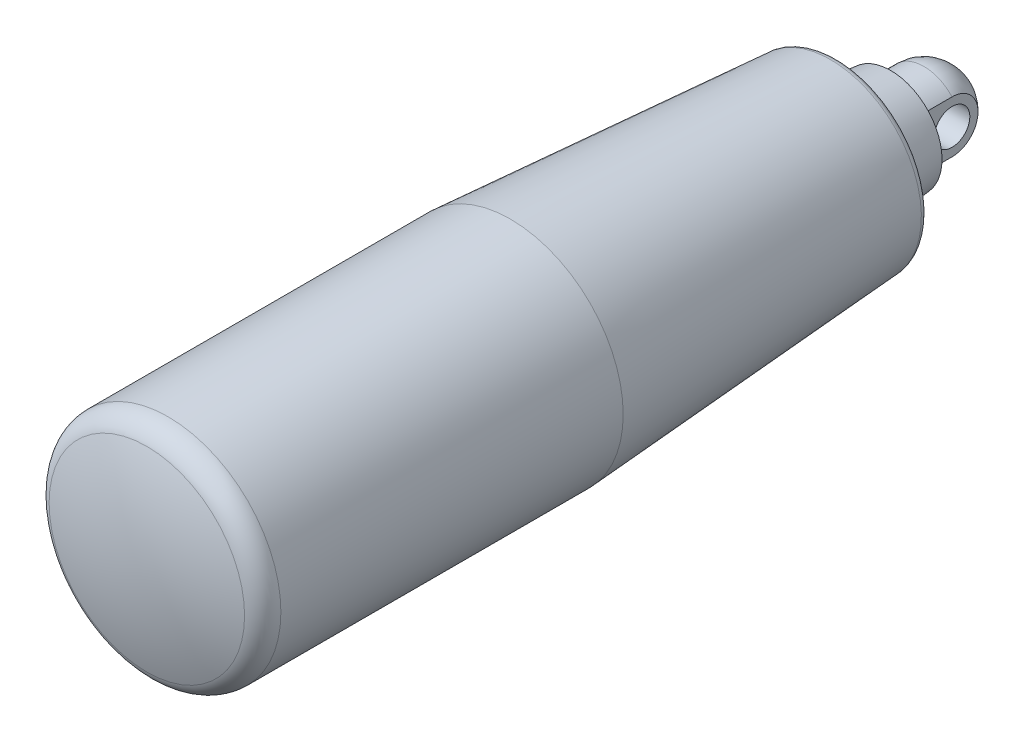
ISO-10303-21;
HEADER;
FILE_DESCRIPTION(('STEP AP214'),'2;1');
FILE_NAME('part.step','',(''),(''),'','','');
FILE_SCHEMA(('AUTOMOTIVE_DESIGN { 1 0 10303 214 1 1 1 1 }'));
ENDSEC;
DATA;
#1=APPLICATION_CONTEXT('core data for automotive mechanical design processes');
#2=APPLICATION_PROTOCOL_DEFINITION('international standard','automotive_design',2000,#1);
#3=PRODUCT_CONTEXT('',#1,'mechanical');
#4=PRODUCT('Part','Part','',(#3));
#5=PRODUCT_RELATED_PRODUCT_CATEGORY('part','',(#4));
#6=PRODUCT_DEFINITION_FORMATION('','',#4);
#7=PRODUCT_DEFINITION_CONTEXT('part definition',#1,'design');
#8=PRODUCT_DEFINITION('design','',#6,#7);
#9=PRODUCT_DEFINITION_SHAPE('','',#8);
#10=(LENGTH_UNIT() NAMED_UNIT(*) SI_UNIT(.MILLI.,.METRE.));
#11=(NAMED_UNIT(*) PLANE_ANGLE_UNIT() SI_UNIT($,.RADIAN.));
#12=(NAMED_UNIT(*) SI_UNIT($,.STERADIAN.) SOLID_ANGLE_UNIT());
#13=UNCERTAINTY_MEASURE_WITH_UNIT(LENGTH_MEASURE(1.E-05),#10,'distance_accuracy_value','');
#14=(GEOMETRIC_REPRESENTATION_CONTEXT(3) GLOBAL_UNCERTAINTY_ASSIGNED_CONTEXT((#13)) GLOBAL_UNIT_ASSIGNED_CONTEXT((#10,
#11,#12)) REPRESENTATION_CONTEXT('',''));
#15=CARTESIAN_POINT('',(0.,0.,0.));
#16=DIRECTION('',(0.,0.,1.));
#17=DIRECTION('',(1.,0.,0.));
#18=AXIS2_PLACEMENT_3D('',#15,#16,#17);
#19=CARTESIAN_POINT('',(20.,0.,0.));
#20=DIRECTION('',(1.,0.,0.));
#21=DIRECTION('',(0.,1.,0.));
#22=AXIS2_PLACEMENT_3D('',#19,#20,#21);
#23=CYLINDRICAL_SURFACE('',#22,2.);
#24=CARTESIAN_POINT('',(-3.1875,0.,0.));
#25=DIRECTION('',(1.,0.,0.));
#26=DIRECTION('',(0.,1.,0.));
#27=AXIS2_PLACEMENT_3D('',#24,#25,#26);
#28=CIRCLE('',#27,2.);
#29=CARTESIAN_POINT('',(-3.1875,2.,0.));
#30=VERTEX_POINT('',#29);
#31=EDGE_CURVE('E86',#30,#30,#28,.F.);
#32=ORIENTED_EDGE('',*,*,#31,.T.);
#33=EDGE_LOOP('',(#32));
#34=FACE_BOUND('',#33,.T.);
#35=CARTESIAN_POINT('',(3.1875,0.,0.));
#36=DIRECTION('',(1.,0.,0.));
#37=DIRECTION('',(0.,1.,0.));
#38=AXIS2_PLACEMENT_3D('',#35,#36,#37);
#39=CIRCLE('',#38,2.);
#40=CARTESIAN_POINT('',(3.1875,2.,0.));
#41=VERTEX_POINT('',#40);
#42=EDGE_CURVE('E19',#41,#41,#39,.F.);
#43=ORIENTED_EDGE('',*,*,#42,.F.);
#44=EDGE_LOOP('',(#43));
#45=FACE_BOUND('',#44,.T.);
#46=ADVANCED_FACE('F14',(#34,#45),#23,.F.);
#47=CARTESIAN_POINT('',(0.00999999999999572,0.,0.00999999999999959));
#48=DIRECTION('',(0.,-1.,0.));
#49=DIRECTION('',(1.,0.,0.));
#50=AXIS2_PLACEMENT_3D('',#47,#48,#49);
#51=CIRCLE('',#50,4.325);
#52=TRIMMED_CURVE('',#51,(PARAMETER_VALUE(-1.57310846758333)),
(PARAMETER_VALUE(1.57310846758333)),.T.,.PARAMETER.);
#53=CARTESIAN_POINT('',(0.,0.,0.00999999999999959));
#54=DIRECTION('',(0.,0.,1.));
#55=AXIS1_PLACEMENT('',#53,#54);
#56=SURFACE_OF_REVOLUTION('',#52,#55);
#57=CARTESIAN_POINT('',(0.,0.,-4.31498843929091));
#58=VERTEX_POINT('',#57);
#59=VERTEX_LOOP('',#58);
#60=FACE_BOUND('',#59,.T.);
#61=CARTESIAN_POINT('',(0.,0.,0.00999999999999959));
#62=DIRECTION('',(0.,0.,-1.));
#63=DIRECTION('',(0.,1.,0.));
#64=AXIS2_PLACEMENT_3D('',#61,#62,#63);
#65=CIRCLE('',#64,4.335);
#66=CARTESIAN_POINT('',(3.1875,2.93803824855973,0.00999999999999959));
#67=VERTEX_POINT('',#66);
#68=CARTESIAN_POINT('',(-3.1875,2.93803824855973,0.00999999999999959));
#69=VERTEX_POINT('',#68);
#70=EDGE_CURVE('E64',#67,#69,#65,.F.);
#71=ORIENTED_EDGE('',*,*,#70,.F.);
#72=CARTESIAN_POINT('',(3.1875,-2.93803824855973,0.00999999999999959));
#73=CARTESIAN_POINT('',(3.1875,-2.93803772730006,-0.0725049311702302));
#74=CARTESIAN_POINT('',(3.1875,-2.93455271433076,-0.154970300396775));
#75=CARTESIAN_POINT('',(3.1875,-2.92064978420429,-0.319310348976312));
#76=CARTESIAN_POINT('',(3.1875,-2.91023220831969,-0.401185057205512));
#77=CARTESIAN_POINT('',(3.1875,-2.86867909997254,-0.644904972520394));
#78=CARTESIAN_POINT('',(3.1875,-2.82724291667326,-0.805116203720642));
#79=CARTESIAN_POINT('',(3.1875,-2.71805801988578,-1.11629702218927));
#80=CARTESIAN_POINT('',(3.1875,-2.65029724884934,-1.26726233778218));
#81=CARTESIAN_POINT('',(3.1875,-2.49040321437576,-1.55566794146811));
#82=CARTESIAN_POINT('',(3.1875,-2.39827465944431,-1.69311083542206));
#83=CARTESIAN_POINT('',(3.1875,-2.19225447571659,-1.95059619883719));
#84=CARTESIAN_POINT('',(3.1875,-2.07836075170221,-2.07063699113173));
#85=CARTESIAN_POINT('',(3.1875,-1.83203648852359,-2.28993589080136));
#86=CARTESIAN_POINT('',(3.1875,-1.69960308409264,-2.38919077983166));
#87=CARTESIAN_POINT('',(3.1875,-1.41984259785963,-2.56418085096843));
#88=CARTESIAN_POINT('',(3.1875,-1.27250161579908,-2.63989380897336));
#89=CARTESIAN_POINT('',(3.1875,-0.967222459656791,-2.76554542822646));
#90=CARTESIAN_POINT('',(3.1875,-0.809284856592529,-2.81548547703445));
#91=CARTESIAN_POINT('',(3.1875,-0.487035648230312,-2.88825864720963));
#92=CARTESIAN_POINT('',(3.1875,-0.322714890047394,-2.91105123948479));
#93=CARTESIAN_POINT('',(3.1875,0.00742633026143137,-2.9287593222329));
#94=CARTESIAN_POINT('',(3.1875,0.173246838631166,-2.92367395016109));
#95=CARTESIAN_POINT('',(3.1875,0.501860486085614,-2.8857454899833));
#96=CARTESIAN_POINT('',(3.1875,0.664650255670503,-2.85287319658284));
#97=CARTESIAN_POINT('',(3.1875,0.98239499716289,-2.7602511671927));
#98=CARTESIAN_POINT('',(3.1875,1.13735002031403,-2.70050160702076));
#99=CARTESIAN_POINT('',(3.1875,1.43493837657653,-2.55584022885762));
#100=CARTESIAN_POINT('',(3.1875,1.57757776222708,-2.47094086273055));
#101=CARTESIAN_POINT('',(3.1875,1.84654328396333,-2.27836992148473));
#102=CARTESIAN_POINT('',(3.1875,1.97287033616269,-2.17069962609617));
#103=CARTESIAN_POINT('',(3.1875,2.20542039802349,-1.93583060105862));
#104=CARTESIAN_POINT('',(3.1875,2.31167541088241,-1.80866355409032));
#105=CARTESIAN_POINT('',(3.1875,2.50133092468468,-1.53822800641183));
#106=CARTESIAN_POINT('',(3.1875,2.58472427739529,-1.39495448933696));
#107=CARTESIAN_POINT('',(3.1875,2.72618380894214,-1.09654409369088));
#108=CARTESIAN_POINT('',(3.1875,2.78426513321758,-0.941414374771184));
#109=CARTESIAN_POINT('',(3.1875,2.87345116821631,-0.623723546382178));
#110=CARTESIAN_POINT('',(3.1875,2.90459729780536,-0.461174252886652));
#111=CARTESIAN_POINT('',(3.1875,2.92726749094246,-0.246288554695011));
#112=CARTESIAN_POINT('',(3.1875,2.9313086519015,-0.195069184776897));
#113=CARTESIAN_POINT('',(3.1875,2.93669033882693,-0.0925734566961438));
#114=CARTESIAN_POINT('',(3.1875,2.93803531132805,-0.0412973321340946));
#115=CARTESIAN_POINT('',(3.1875,2.93803824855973,0.00999999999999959));
#116=B_SPLINE_CURVE_WITH_KNOTS('',3,(#72,#73,#74,#75,#76,#77,#78,#79,#80,#81,#82,#83,#84,#85,
#86,#87,#88,#89,#90,#91,#92,#93,#94,#95,#96,#97,#98,#99,#100,#101,#102,#103,#104,#105,#106,#107,
#108,#109,#110,#111,#112,#113,#114,#115),.UNSPECIFIED.,.F.,.F.,(4,2,2,2,2,2,2,2,2,2,2,2,2,2,2,2,
2,2,2,2,2,4),(0.,0.247362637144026,0.494713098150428,0.988613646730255,1.48274068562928,
1.97677231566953,2.47085152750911,2.96500718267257,3.45962792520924,3.95422203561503,
4.44955361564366,4.94490052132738,5.4407687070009,5.93663364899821,6.43225349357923,
6.92784549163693,7.42264051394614,7.91759006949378,8.4122430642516,8.90613406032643,
9.06022034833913,9.21405230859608),.UNSPECIFIED.);
#117=CARTESIAN_POINT('',(3.1875,-2.93803824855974,0.00999999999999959));
#118=VERTEX_POINT('',#117);
#119=EDGE_CURVE('E57',#118,#67,#116,.T.);
#120=ORIENTED_EDGE('',*,*,#119,.F.);
#121=CARTESIAN_POINT('',(0.,0.,0.00999999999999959));
#122=DIRECTION('',(0.,0.,-1.));
#123=DIRECTION('',(0.,1.,0.));
#124=AXIS2_PLACEMENT_3D('',#121,#122,#123);
#125=CIRCLE('',#124,4.335);
#126=CARTESIAN_POINT('',(-3.1875,-2.93803824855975,0.00999999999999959));
#127=VERTEX_POINT('',#126);
#128=EDGE_CURVE('E89',#127,#118,#125,.F.);
#129=ORIENTED_EDGE('',*,*,#128,.F.);
#130=CARTESIAN_POINT('',(-3.1875,-2.93803824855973,0.00999999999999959));
#131=CARTESIAN_POINT('',(-3.1875,-2.93803772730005,-0.0725049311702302));
#132=CARTESIAN_POINT('',(-3.1875,-2.93455271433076,-0.154970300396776));
#133=CARTESIAN_POINT('',(-3.1875,-2.92064978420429,-0.319310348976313));
#134=CARTESIAN_POINT('',(-3.1875,-2.91023220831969,-0.401185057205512));
#135=CARTESIAN_POINT('',(-3.1875,-2.86867909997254,-0.644904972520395));
#136=CARTESIAN_POINT('',(-3.1875,-2.82724291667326,-0.805116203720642));
#137=CARTESIAN_POINT('',(-3.1875,-2.71805801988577,-1.11629702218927));
#138=CARTESIAN_POINT('',(-3.1875,-2.65029724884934,-1.26726233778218));
#139=CARTESIAN_POINT('',(-3.1875,-2.49040321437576,-1.55566794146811));
#140=CARTESIAN_POINT('',(-3.1875,-2.39827465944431,-1.69311083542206));
#141=CARTESIAN_POINT('',(-3.1875,-2.19225447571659,-1.95059619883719));
#142=CARTESIAN_POINT('',(-3.1875,-2.07836075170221,-2.07063699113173));
#143=CARTESIAN_POINT('',(-3.1875,-1.83203648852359,-2.28993589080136));
#144=CARTESIAN_POINT('',(-3.1875,-1.69960308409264,-2.38919077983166));
#145=CARTESIAN_POINT('',(-3.1875,-1.41984259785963,-2.56418085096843));
#146=CARTESIAN_POINT('',(-3.1875,-1.27250161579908,-2.63989380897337));
#147=CARTESIAN_POINT('',(-3.1875,-0.967222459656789,-2.76554542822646));
#148=CARTESIAN_POINT('',(-3.1875,-0.809284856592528,-2.81548547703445));
#149=CARTESIAN_POINT('',(-3.1875,-0.48703564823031,-2.88825864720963));
#150=CARTESIAN_POINT('',(-3.1875,-0.322714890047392,-2.91105123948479));
#151=CARTESIAN_POINT('',(-3.1875,0.00742633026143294,-2.9287593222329));
#152=CARTESIAN_POINT('',(-3.1875,0.173246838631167,-2.92367395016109));
#153=CARTESIAN_POINT('',(-3.1875,0.501860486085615,-2.8857454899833));
#154=CARTESIAN_POINT('',(-3.1875,0.664650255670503,-2.85287319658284));
#155=CARTESIAN_POINT('',(-3.1875,0.982394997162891,-2.7602511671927));
#156=CARTESIAN_POINT('',(-3.1875,1.13735002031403,-2.70050160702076));
#157=CARTESIAN_POINT('',(-3.1875,1.43493837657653,-2.55584022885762));
#158=CARTESIAN_POINT('',(-3.1875,1.57757776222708,-2.47094086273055));
#159=CARTESIAN_POINT('',(-3.1875,1.84654328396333,-2.27836992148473));
#160=CARTESIAN_POINT('',(-3.1875,1.9728703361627,-2.17069962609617));
#161=CARTESIAN_POINT('',(-3.1875,2.20542039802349,-1.93583060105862));
#162=CARTESIAN_POINT('',(-3.1875,2.31167541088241,-1.80866355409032));
#163=CARTESIAN_POINT('',(-3.1875,2.50133092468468,-1.53822800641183));
#164=CARTESIAN_POINT('',(-3.1875,2.58472427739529,-1.39495448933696));
#165=CARTESIAN_POINT('',(-3.1875,2.72618380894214,-1.09654409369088));
#166=CARTESIAN_POINT('',(-3.1875,2.78426513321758,-0.941414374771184));
#167=CARTESIAN_POINT('',(-3.1875,2.87345116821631,-0.623723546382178));
#168=CARTESIAN_POINT('',(-3.1875,2.90459729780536,-0.461174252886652));
#169=CARTESIAN_POINT('',(-3.1875,2.92726749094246,-0.246288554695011));
#170=CARTESIAN_POINT('',(-3.1875,2.9313086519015,-0.195069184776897));
#171=CARTESIAN_POINT('',(-3.1875,2.93669033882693,-0.0925734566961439));
#172=CARTESIAN_POINT('',(-3.1875,2.93803531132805,-0.0412973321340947));
#173=CARTESIAN_POINT('',(-3.1875,2.93803824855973,0.00999999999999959));
#174=B_SPLINE_CURVE_WITH_KNOTS('',3,(#130,#131,#132,#133,#134,#135,#136,#137,#138,#139,#140,
#141,#142,#143,#144,#145,#146,#147,#148,#149,#150,#151,#152,#153,#154,#155,#156,#157,#158,#159,
#160,#161,#162,#163,#164,#165,#166,#167,#168,#169,#170,#171,#172,#173),.UNSPECIFIED.,.F.,.F.,(4,
2,2,2,2,2,2,2,2,2,2,2,2,2,2,2,2,2,2,2,2,4),(0.,0.247362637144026,0.494713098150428,
0.988613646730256,1.48274068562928,1.97677231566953,2.47085152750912,2.96500718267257,
3.45962792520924,3.95422203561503,4.44955361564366,4.94490052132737,5.44076870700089,
5.93663364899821,6.43225349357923,6.92784549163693,7.42264051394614,7.91759006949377,
8.4122430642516,8.90613406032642,9.06022034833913,9.21405230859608),.UNSPECIFIED.);
#175=EDGE_CURVE('E67',#127,#69,#174,.T.);
#176=ORIENTED_EDGE('',*,*,#175,.T.);
#177=EDGE_LOOP('',(#71,#120,#129,#176));
#178=FACE_BOUND('',#177,.T.);
#179=ADVANCED_FACE('F16',(#60,#178),#56,.T.);
#180=CARTESIAN_POINT('',(3.1875,0.,-10.25));
#181=DIRECTION('',(1.,0.,0.));
#182=DIRECTION('',(0.,1.,0.));
#183=AXIS2_PLACEMENT_3D('',#180,#181,#182);
#184=PLANE('',#183);
#185=DIRECTION('',(0.,0.,-1.));
#186=VECTOR('',#185,1.);
#187=CARTESIAN_POINT('',(3.1875,-2.93803824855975,-4.31498843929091));
#188=LINE('',#187,#186);
#189=CARTESIAN_POINT('',(3.1875,-2.93803824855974,3.75));
#190=VERTEX_POINT('',#189);
#191=EDGE_CURVE('E87',#118,#190,#188,.F.);
#192=ORIENTED_EDGE('',*,*,#191,.F.);
#193=ORIENTED_EDGE('',*,*,#119,.T.);
#194=DIRECTION('',(0.,0.,-1.));
#195=VECTOR('',#194,1.);
#196=CARTESIAN_POINT('',(3.1875,2.93803824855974,-4.31498843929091));
#197=LINE('',#196,#195);
#198=CARTESIAN_POINT('',(3.1875,2.93803824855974,3.75));
#199=VERTEX_POINT('',#198);
#200=EDGE_CURVE('E70',#199,#67,#197,.T.);
#201=ORIENTED_EDGE('',*,*,#200,.F.);
#202=DIRECTION('',(0.,-1.,0.));
#203=VECTOR('',#202,1.);
#204=CARTESIAN_POINT('',(3.1875,0.,3.75));
#205=LINE('',#204,#203);
#206=EDGE_CURVE('E69',#199,#190,#205,.T.);
#207=ORIENTED_EDGE('',*,*,#206,.T.);
#208=EDGE_LOOP('',(#192,#193,#201,#207));
#209=FACE_BOUND('',#208,.T.);
#210=ORIENTED_EDGE('',*,*,#42,.T.);
#211=EDGE_LOOP('',(#210));
#212=FACE_BOUND('',#211,.T.);
#213=ADVANCED_FACE('F62',(#209,#212),#184,.T.);
#214=CARTESIAN_POINT('',(0.,0.,-4.31498843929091));
#215=DIRECTION('',(0.,0.,-1.));
#216=DIRECTION('',(0.,1.,0.));
#217=AXIS2_PLACEMENT_3D('',#214,#215,#216);
#218=CYLINDRICAL_SURFACE('',#217,4.335);
#219=ORIENTED_EDGE('',*,*,#128,.T.);
#220=ORIENTED_EDGE('',*,*,#191,.T.);
#221=CARTESIAN_POINT('',(0.,0.,3.75));
#222=DIRECTION('',(0.,0.,-1.));
#223=DIRECTION('',(0.,1.,0.));
#224=AXIS2_PLACEMENT_3D('',#221,#222,#223);
#225=CIRCLE('',#224,4.335);
#226=CARTESIAN_POINT('',(-3.1875,-2.93803824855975,3.75));
#227=VERTEX_POINT('',#226);
#228=EDGE_CURVE('E111',#190,#227,#225,.T.);
#229=ORIENTED_EDGE('',*,*,#228,.T.);
#230=DIRECTION('',(0.,0.,1.));
#231=VECTOR('',#230,1.);
#232=CARTESIAN_POINT('',(-3.1875,-2.93803824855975,-10.25));
#233=LINE('',#232,#231);
#234=EDGE_CURVE('E83',#227,#127,#233,.F.);
#235=ORIENTED_EDGE('',*,*,#234,.T.);
#236=EDGE_LOOP('',(#219,#220,#229,#235));
#237=FACE_BOUND('',#236,.T.);
#238=ADVANCED_FACE('F124',(#237),#218,.T.);
#239=CARTESIAN_POINT('',(-3.1875,0.,-10.25));
#240=DIRECTION('',(1.,0.,0.));
#241=DIRECTION('',(0.,1.,0.));
#242=AXIS2_PLACEMENT_3D('',#239,#240,#241);
#243=PLANE('',#242);
#244=DIRECTION('',(0.,0.,-1.));
#245=VECTOR('',#244,1.);
#246=CARTESIAN_POINT('',(-3.1875,2.93803824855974,-4.31498843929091));
#247=LINE('',#246,#245);
#248=CARTESIAN_POINT('',(-3.1875,2.93803824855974,3.75));
#249=VERTEX_POINT('',#248);
#250=EDGE_CURVE('E78',#69,#249,#247,.F.);
#251=ORIENTED_EDGE('',*,*,#250,.F.);
#252=ORIENTED_EDGE('',*,*,#175,.F.);
#253=ORIENTED_EDGE('',*,*,#234,.F.);
#254=DIRECTION('',(0.,-1.,0.));
#255=VECTOR('',#254,1.);
#256=CARTESIAN_POINT('',(-3.1875,0.,3.75));
#257=LINE('',#256,#255);
#258=EDGE_CURVE('E34',#227,#249,#257,.F.);
#259=ORIENTED_EDGE('',*,*,#258,.T.);
#260=EDGE_LOOP('',(#251,#252,#253,#259));
#261=FACE_BOUND('',#260,.T.);
#262=ORIENTED_EDGE('',*,*,#31,.F.);
#263=EDGE_LOOP('',(#262));
#264=FACE_BOUND('',#263,.T.);
#265=ADVANCED_FACE('F119',(#261,#264),#243,.F.);
#266=CARTESIAN_POINT('',(0.,0.,-4.31498843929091));
#267=DIRECTION('',(0.,0.,-1.));
#268=DIRECTION('',(0.,1.,0.));
#269=AXIS2_PLACEMENT_3D('',#266,#267,#268);
#270=CYLINDRICAL_SURFACE('',#269,4.335);
#271=ORIENTED_EDGE('',*,*,#200,.T.);
#272=ORIENTED_EDGE('',*,*,#70,.T.);
#273=ORIENTED_EDGE('',*,*,#250,.T.);
#274=CARTESIAN_POINT('',(0.,0.,3.75));
#275=DIRECTION('',(0.,0.,-1.));
#276=DIRECTION('',(0.,1.,0.));
#277=AXIS2_PLACEMENT_3D('',#274,#275,#276);
#278=CIRCLE('',#277,4.335);
#279=EDGE_CURVE('E75',#249,#199,#278,.T.);
#280=ORIENTED_EDGE('',*,*,#279,.T.);
#281=EDGE_LOOP('',(#271,#272,#273,#280));
#282=FACE_BOUND('',#281,.T.);
#283=ADVANCED_FACE('F73',(#282),#270,.T.);
#284=CARTESIAN_POINT('',(0.,0.,3.75));
#285=DIRECTION('',(0.,0.,1.));
#286=DIRECTION('',(0.,-1.,0.));
#287=AXIS2_PLACEMENT_3D('',#284,#285,#286);
#288=PLANE('',#287);
#289=ORIENTED_EDGE('',*,*,#258,.F.);
#290=ORIENTED_EDGE('',*,*,#228,.F.);
#291=ORIENTED_EDGE('',*,*,#206,.F.);
#292=ORIENTED_EDGE('',*,*,#279,.F.);
#293=EDGE_LOOP('',(#289,#290,#291,#292));
#294=FACE_BOUND('',#293,.T.);
#295=CARTESIAN_POINT('',(0.,0.,3.75000000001));
#296=DIRECTION('',(0.,0.,1.));
#297=DIRECTION('',(1.,0.,0.));
#298=AXIS2_PLACEMENT_3D('',#295,#296,#297);
#299=CIRCLE('',#298,5.79692670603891);
#300=CARTESIAN_POINT('',(5.79692670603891,0.,3.75000000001));
#301=VERTEX_POINT('',#300);
#302=EDGE_CURVE('E107',#301,#301,#299,.T.);
#303=ORIENTED_EDGE('',*,*,#302,.F.);
#304=EDGE_LOOP('',(#303));
#305=FACE_BOUND('',#304,.T.);
#306=ADVANCED_FACE('F210',(#294,#305),#288,.F.);
#307=CARTESIAN_POINT('',(0.,0.,9.24999999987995));
#308=DIRECTION('',(0.,0.,1.));
#309=DIRECTION('',(1.,0.,0.));
#310=AXIS2_PLACEMENT_3D('',#307,#308,#309);
#311=CONICAL_SURFACE('',#310,6.37499999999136,0.104719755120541);
#312=ORIENTED_EDGE('',*,*,#302,.T.);
#313=EDGE_LOOP('',(#312));
#314=FACE_BOUND('',#313,.T.);
#315=CARTESIAN_POINT('',(0.,0.,9.24999999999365));
#316=DIRECTION('',(0.,0.,1.));
#317=DIRECTION('',(1.,0.,0.));
#318=AXIS2_PLACEMENT_3D('',#315,#316,#317);
#319=CIRCLE('',#318,6.37500000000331);
#320=CARTESIAN_POINT('',(6.37500000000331,0.,9.24999999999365));
#321=VERTEX_POINT('',#320);
#322=EDGE_CURVE('E104',#321,#321,#319,.F.);
#323=ORIENTED_EDGE('',*,*,#322,.T.);
#324=EDGE_LOOP('',(#323));
#325=FACE_BOUND('',#324,.T.);
#326=ADVANCED_FACE('F213',(#314,#325),#311,.T.);
#327=CARTESIAN_POINT('',(0.,-6.375,9.25));
#328=DIRECTION('',(0.,0.,1.));
#329=DIRECTION('',(0.,-1.,0.));
#330=AXIS2_PLACEMENT_3D('',#327,#328,#329);
#331=PLANE('',#330);
#332=ORIENTED_EDGE('',*,*,#322,.F.);
#333=EDGE_LOOP('',(#332));
#334=FACE_BOUND('',#333,.T.);
#335=CARTESIAN_POINT('',(0.,0.,9.25));
#336=DIRECTION('',(0.,0.,-1.));
#337=DIRECTION('',(0.,1.,0.));
#338=AXIS2_PLACEMENT_3D('',#335,#336,#337);
#339=CIRCLE('',#338,8.925);
#340=CARTESIAN_POINT('',(0.,8.925,9.25));
#341=VERTEX_POINT('',#340);
#342=EDGE_CURVE('E101',#341,#341,#339,.F.);
#343=ORIENTED_EDGE('',*,*,#342,.F.);
#344=EDGE_LOOP('',(#343));
#345=FACE_BOUND('',#344,.T.);
#346=ADVANCED_FACE('F218',(#334,#345),#331,.F.);
#347=CARTESIAN_POINT('',(0.,0.,89.75));
#348=DIRECTION('',(0.,0.,-1.));
#349=DIRECTION('',(0.,1.,0.));
#350=AXIS2_PLACEMENT_3D('',#347,#348,#349);
#351=CYLINDRICAL_SURFACE('',#350,8.925);
#352=ORIENTED_EDGE('',*,*,#342,.T.);
#353=EDGE_LOOP('',(#352));
#354=FACE_BOUND('',#353,.T.);
#355=CARTESIAN_POINT('',(0.,0.,9.75));
#356=DIRECTION('',(0.,0.,-1.));
#357=DIRECTION('',(0.,1.,0.));
#358=AXIS2_PLACEMENT_3D('',#355,#356,#357);
#359=CIRCLE('',#358,8.925);
#360=CARTESIAN_POINT('',(0.,8.925,9.75));
#361=VERTEX_POINT('',#360);
#362=EDGE_CURVE('E98',#361,#361,#359,.T.);
#363=ORIENTED_EDGE('',*,*,#362,.T.);
#364=EDGE_LOOP('',(#363));
#365=FACE_BOUND('',#364,.T.);
#366=ADVANCED_FACE('F186',(#354,#365),#351,.T.);
#367=CARTESIAN_POINT('',(0.,-8.925,9.75));
#368=DIRECTION('',(0.,0.,1.));
#369=DIRECTION('',(0.,-1.,0.));
#370=AXIS2_PLACEMENT_3D('',#367,#368,#369);
#371=PLANE('',#370);
#372=ORIENTED_EDGE('',*,*,#362,.F.);
#373=EDGE_LOOP('',(#372));
#374=FACE_BOUND('',#373,.T.);
#375=CARTESIAN_POINT('',(0.,0.,9.75));
#376=DIRECTION('',(0.,0.,1.));
#377=DIRECTION('',(0.,-1.,0.));
#378=AXIS2_PLACEMENT_3D('',#375,#376,#377);
#379=CIRCLE('',#378,9.40656480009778);
#380=CARTESIAN_POINT('',(0.,-9.40656480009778,9.75));
#381=VERTEX_POINT('',#380);
#382=EDGE_CURVE('E97',#381,#381,#379,.T.);
#383=ORIENTED_EDGE('',*,*,#382,.F.);
#384=EDGE_LOOP('',(#383));
#385=FACE_BOUND('',#384,.T.);
#386=ADVANCED_FACE('F181',(#374,#385),#371,.F.);
#387=CARTESIAN_POINT('',(0.,1.66533453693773E-13,56.5999999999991));
#388=DIRECTION('',(0.,-1.,0.));
#389=DIRECTION('',(1.,0.,0.));
#390=AXIS2_PLACEMENT_3D('',#387,#388,#389);
#391=SPHERICAL_SURFACE('',#390,33.1500000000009);
#392=CARTESIAN_POINT('',(0.,0.,87.8541197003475));
#393=DIRECTION('',(0.,0.,1.));
#394=DIRECTION('',(0.,-1.,0.));
#395=AXIS2_PLACEMENT_3D('',#392,#393,#394);
#396=CIRCLE('',#395,11.0500000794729);
#397=CARTESIAN_POINT('',(0.,-11.0500000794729,87.8541197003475));
#398=VERTEX_POINT('',#397);
#399=EDGE_CURVE('E93',#398,#398,#396,.F.);
#400=ORIENTED_EDGE('',*,*,#399,.F.);
#401=EDGE_LOOP('',(#400));
#402=FACE_BOUND('',#401,.T.);
#403=ADVANCED_FACE('F178',(#402),#391,.T.);
#404=CARTESIAN_POINT('',(0.,0.,10.6));
#405=DIRECTION('',(0.,0.,1.));
#406=DIRECTION('',(0.,-1.,0.));
#407=AXIS2_PLACEMENT_3D('',#404,#405,#406);
#408=TOROIDAL_SURFACE('',#407,9.40656480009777,0.85);
#409=CARTESIAN_POINT('',(0.,0.,10.5415575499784));
#410=DIRECTION('',(0.,0.,1.));
#411=DIRECTION('',(0.,-1.,0.));
#412=AXIS2_PLACEMENT_3D('',#409,#410,#411);
#413=CIRCLE('',#412,10.2545532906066);
#414=CARTESIAN_POINT('',(0.,-10.2545532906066,10.5415575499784));
#415=VERTEX_POINT('',#414);
#416=EDGE_CURVE('E96',#415,#415,#413,.T.);
#417=ORIENTED_EDGE('',*,*,#416,.F.);
#418=EDGE_LOOP('',(#417));
#419=FACE_BOUND('',#418,.T.);
#420=ORIENTED_EDGE('',*,*,#382,.T.);
#421=EDGE_LOOP('',(#420));
#422=FACE_BOUND('',#421,.T.);
#423=ADVANCED_FACE('F163',(#419,#422),#408,.T.);
#424=CARTESIAN_POINT('',(0.,0.,85.4499566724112));
#425=DIRECTION('',(0.,0.,1.));
#426=DIRECTION('',(0.,-1.,0.));
#427=AXIS2_PLACEMENT_3D('',#424,#425,#426);
#428=TOROIDAL_SURFACE('',#427,10.2,2.55);
#429=ORIENTED_EDGE('',*,*,#399,.T.);
#430=EDGE_LOOP('',(#429));
#431=FACE_BOUND('',#430,.T.);
#432=CARTESIAN_POINT('',(0.,0.,85.4499566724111));
#433=DIRECTION('',(0.,0.,-1.));
#434=DIRECTION('',(0.,1.,0.));
#435=AXIS2_PLACEMENT_3D('',#432,#433,#434);
#436=CIRCLE('',#435,12.75);
#437=CARTESIAN_POINT('',(0.,12.75,85.4499566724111));
#438=VERTEX_POINT('',#437);
#439=EDGE_CURVE('E25',#438,#438,#436,.T.);
#440=ORIENTED_EDGE('',*,*,#439,.F.);
#441=EDGE_LOOP('',(#440));
#442=FACE_BOUND('',#441,.T.);
#443=ADVANCED_FACE('F155',(#431,#442),#428,.T.);
#444=CARTESIAN_POINT('',(0.,0.,46.75));
#445=DIRECTION('',(0.,0.,1.));
#446=DIRECTION('',(1.,0.,0.));
#447=AXIS2_PLACEMENT_3D('',#444,#445,#446);
#448=CONICAL_SURFACE('',#447,12.75,0.0688101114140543);
#449=ORIENTED_EDGE('',*,*,#416,.T.);
#450=EDGE_LOOP('',(#449));
#451=FACE_BOUND('',#450,.T.);
#452=CARTESIAN_POINT('',(0.,0.,46.75));
#453=DIRECTION('',(0.,0.,-1.));
#454=DIRECTION('',(0.,1.,0.));
#455=AXIS2_PLACEMENT_3D('',#452,#453,#454);
#456=CIRCLE('',#455,12.75);
#457=CARTESIAN_POINT('',(0.,12.75,46.75));
#458=VERTEX_POINT('',#457);
#459=EDGE_CURVE('E9',#458,#458,#456,.F.);
#460=ORIENTED_EDGE('',*,*,#459,.F.);
#461=EDGE_LOOP('',(#460));
#462=FACE_BOUND('',#461,.T.);
#463=ADVANCED_FACE('F148',(#451,#462),#448,.T.);
#464=CARTESIAN_POINT('',(0.,0.,89.75));
#465=DIRECTION('',(0.,0.,-1.));
#466=DIRECTION('',(0.,1.,0.));
#467=AXIS2_PLACEMENT_3D('',#464,#465,#466);
#468=CYLINDRICAL_SURFACE('',#467,12.75);
#469=ORIENTED_EDGE('',*,*,#459,.T.);
#470=EDGE_LOOP('',(#469));
#471=FACE_BOUND('',#470,.T.);
#472=ORIENTED_EDGE('',*,*,#439,.T.);
#473=EDGE_LOOP('',(#472));
#474=FACE_BOUND('',#473,.T.);
#475=ADVANCED_FACE('F146',(#471,#474),#468,.T.);
#476=CLOSED_SHELL('',(#46,#179,#213,#238,#265,#283,#306,#326,#346,#366,#386,#403,#423,#443,#463,#475));
#477=MANIFOLD_SOLID_BREP('B1',#476);
#478=ADVANCED_BREP_SHAPE_REPRESENTATION('',(#18,#477),#14);
#479=SHAPE_DEFINITION_REPRESENTATION(#9,#478);
ENDSEC;
END-ISO-10303-21;
